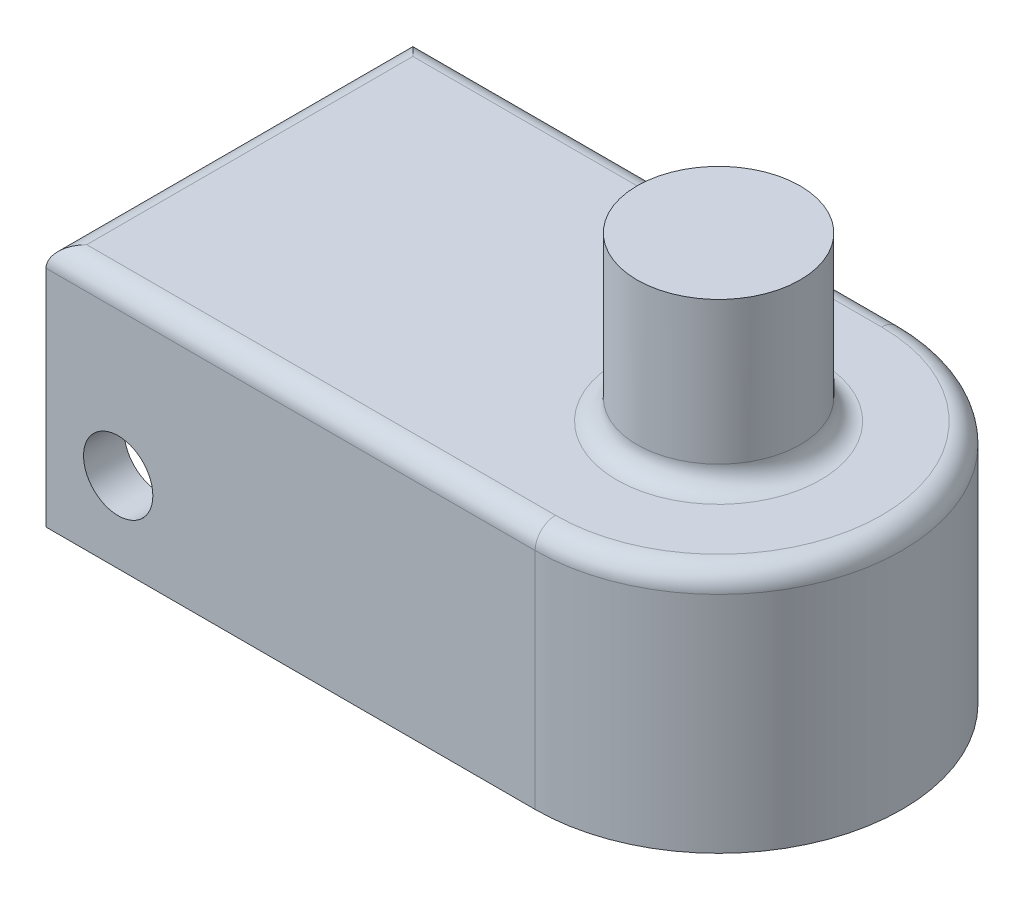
ISO-10303-21;
HEADER;
FILE_DESCRIPTION(('STEP AP214'),'2;1');
FILE_NAME('part.step','',(''),(''),'','','');
FILE_SCHEMA(('AUTOMOTIVE_DESIGN { 1 0 10303 214 1 1 1 1 }'));
ENDSEC;
DATA;
#1=APPLICATION_CONTEXT('core data for automotive mechanical design processes');
#2=APPLICATION_PROTOCOL_DEFINITION('international standard','automotive_design',2000,#1);
#3=PRODUCT_CONTEXT('',#1,'mechanical');
#4=PRODUCT('Part','Part','',(#3));
#5=PRODUCT_RELATED_PRODUCT_CATEGORY('part','',(#4));
#6=PRODUCT_DEFINITION_FORMATION('','',#4);
#7=PRODUCT_DEFINITION_CONTEXT('part definition',#1,'design');
#8=PRODUCT_DEFINITION('design','',#6,#7);
#9=PRODUCT_DEFINITION_SHAPE('','',#8);
#10=(LENGTH_UNIT() NAMED_UNIT(*) SI_UNIT(.MILLI.,.METRE.));
#11=(NAMED_UNIT(*) PLANE_ANGLE_UNIT() SI_UNIT($,.RADIAN.));
#12=(NAMED_UNIT(*) SI_UNIT($,.STERADIAN.) SOLID_ANGLE_UNIT());
#13=UNCERTAINTY_MEASURE_WITH_UNIT(LENGTH_MEASURE(1.E-05),#10,'distance_accuracy_value','');
#14=(GEOMETRIC_REPRESENTATION_CONTEXT(3) GLOBAL_UNCERTAINTY_ASSIGNED_CONTEXT((#13)) GLOBAL_UNIT_ASSIGNED_CONTEXT((#10,
#11,#12)) REPRESENTATION_CONTEXT('',''));
#15=CARTESIAN_POINT('',(0.,0.,0.));
#16=DIRECTION('',(0.,0.,1.));
#17=DIRECTION('',(1.,0.,0.));
#18=AXIS2_PLACEMENT_3D('',#15,#16,#17);
#19=CARTESIAN_POINT('',(152.4,76.2,-57.15));
#20=DIRECTION('',(0.,-1.,0.));
#21=DIRECTION('',(0.,0.,-1.));
#22=AXIS2_PLACEMENT_3D('',#19,#20,#21);
#23=PLANE('',#22);
#24=CARTESIAN_POINT('',(152.4,76.2,-57.15));
#25=DIRECTION('',(0.,-1.,0.));
#26=DIRECTION('',(0.,0.,-1.));
#27=AXIS2_PLACEMENT_3D('',#24,#25,#26);
#28=CIRCLE('',#27,31.75);
#29=CARTESIAN_POINT('',(152.4,76.2,-88.9));
#30=VERTEX_POINT('',#29);
#31=EDGE_CURVE('E185',#30,#30,#28,.T.);
#32=ORIENTED_EDGE('',*,*,#31,.T.);
#33=EDGE_LOOP('',(#32));
#34=FACE_BOUND('',#33,.T.);
#35=CARTESIAN_POINT('',(152.4,76.2,-57.15));
#36=DIRECTION('',(0.,-1.,0.));
#37=DIRECTION('',(0.,0.,-1.));
#38=AXIS2_PLACEMENT_3D('',#35,#36,#37);
#39=CIRCLE('',#38,50.8);
#40=CARTESIAN_POINT('',(152.4,76.2,-6.35));
#41=VERTEX_POINT('',#40);
#42=CARTESIAN_POINT('',(152.4,76.2,-107.95));
#43=VERTEX_POINT('',#42);
#44=EDGE_CURVE('E180',#41,#43,#39,.F.);
#45=ORIENTED_EDGE('',*,*,#44,.T.);
#46=DIRECTION('',(-1.,0.,0.));
#47=VECTOR('',#46,1.);
#48=CARTESIAN_POINT('',(152.4,76.2,-107.95));
#49=LINE('',#48,#47);
#50=CARTESIAN_POINT('',(6.34999999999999,76.2,-107.95));
#51=VERTEX_POINT('',#50);
#52=EDGE_CURVE('E182',#43,#51,#49,.T.);
#53=ORIENTED_EDGE('',*,*,#52,.T.);
#54=DIRECTION('',(0.,0.,1.));
#55=VECTOR('',#54,1.);
#56=CARTESIAN_POINT('',(6.34999999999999,76.2,-57.15));
#57=LINE('',#56,#55);
#58=CARTESIAN_POINT('',(6.34999999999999,76.2,-6.35));
#59=VERTEX_POINT('',#58);
#60=EDGE_CURVE('E178',#51,#59,#57,.T.);
#61=ORIENTED_EDGE('',*,*,#60,.T.);
#62=DIRECTION('',(1.,0.,0.));
#63=VECTOR('',#62,1.);
#64=CARTESIAN_POINT('',(152.4,76.2,-6.35));
#65=LINE('',#64,#63);
#66=EDGE_CURVE('E172',#59,#41,#65,.T.);
#67=ORIENTED_EDGE('',*,*,#66,.T.);
#68=EDGE_LOOP('',(#45,#53,#61,#67));
#69=FACE_BOUND('',#68,.T.);
#70=ADVANCED_FACE('F31',(#34,#69),#23,.F.);
#71=CARTESIAN_POINT('',(0.,76.2,0.));
#72=DIRECTION('',(1.,0.,0.));
#73=DIRECTION('',(0.,0.,-1.));
#74=AXIS2_PLACEMENT_3D('',#71,#72,#73);
#75=PLANE('',#74);
#76=DIRECTION('',(0.,-1.,0.));
#77=VECTOR('',#76,1.);
#78=CARTESIAN_POINT('',(0.,76.2,0.));
#79=LINE('',#78,#77);
#80=CARTESIAN_POINT('',(0.,69.85,0.));
#81=VERTEX_POINT('',#80);
#82=CARTESIAN_POINT('',(0.,0.,0.));
#83=VERTEX_POINT('',#82);
#84=EDGE_CURVE('E170',#81,#83,#79,.T.);
#85=ORIENTED_EDGE('',*,*,#84,.F.);
#86=DIRECTION('',(0.,0.,1.));
#87=VECTOR('',#86,1.);
#88=CARTESIAN_POINT('',(0.,69.85,0.));
#89=LINE('',#88,#87);
#90=CARTESIAN_POINT('',(0.,69.85,-114.3));
#91=VERTEX_POINT('',#90);
#92=EDGE_CURVE('E40',#81,#91,#89,.F.);
#93=ORIENTED_EDGE('',*,*,#92,.T.);
#94=DIRECTION('',(0.,-1.,0.));
#95=VECTOR('',#94,1.);
#96=CARTESIAN_POINT('',(0.,76.2,-114.3));
#97=LINE('',#96,#95);
#98=CARTESIAN_POINT('',(0.,0.,-114.3));
#99=VERTEX_POINT('',#98);
#100=EDGE_CURVE('E164',#91,#99,#97,.T.);
#101=ORIENTED_EDGE('',*,*,#100,.T.);
#102=DIRECTION('',(0.,0.,1.));
#103=VECTOR('',#102,1.);
#104=CARTESIAN_POINT('',(0.,0.,0.));
#105=LINE('',#104,#103);
#106=CARTESIAN_POINT('',(0.,0.,-101.6));
#107=VERTEX_POINT('',#106);
#108=EDGE_CURVE('E153',#99,#107,#105,.T.);
#109=ORIENTED_EDGE('',*,*,#108,.T.);
#110=DIRECTION('',(0.,-1.,0.));
#111=VECTOR('',#110,1.);
#112=CARTESIAN_POINT('',(0.,37.592,-101.6));
#113=LINE('',#112,#111);
#114=CARTESIAN_POINT('',(0.,37.592,-101.6));
#115=VERTEX_POINT('',#114);
#116=EDGE_CURVE('E120',#115,#107,#113,.T.);
#117=ORIENTED_EDGE('',*,*,#116,.F.);
#118=DIRECTION('',(0.,0.,-1.));
#119=VECTOR('',#118,1.);
#120=CARTESIAN_POINT('',(0.,37.592,-12.7));
#121=LINE('',#120,#119);
#122=CARTESIAN_POINT('',(0.,37.592,-12.7));
#123=VERTEX_POINT('',#122);
#124=EDGE_CURVE('E127',#123,#115,#121,.T.);
#125=ORIENTED_EDGE('',*,*,#124,.F.);
#126=DIRECTION('',(0.,-1.,0.));
#127=VECTOR('',#126,1.);
#128=CARTESIAN_POINT('',(0.,37.592,-12.7));
#129=LINE('',#128,#127);
#130=CARTESIAN_POINT('',(0.,0.,-12.7));
#131=VERTEX_POINT('',#130);
#132=EDGE_CURVE('E109',#123,#131,#129,.T.);
#133=ORIENTED_EDGE('',*,*,#132,.T.);
#134=EDGE_CURVE('E149',#131,#83,#105,.T.);
#135=ORIENTED_EDGE('',*,*,#134,.T.);
#136=EDGE_LOOP('',(#85,#93,#101,#109,#117,#125,#133,#135));
#137=FACE_BOUND('',#136,.T.);
#138=ADVANCED_FACE('F132',(#137),#75,.F.);
#139=CARTESIAN_POINT('',(0.,76.2,0.));
#140=DIRECTION('',(0.,0.,-1.));
#141=DIRECTION('',(-1.,0.,0.));
#142=AXIS2_PLACEMENT_3D('',#139,#140,#141);
#143=PLANE('',#142);
#144=CARTESIAN_POINT('',(22.4900013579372,25.1025379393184,0.));
#145=DIRECTION('',(0.,0.,1.));
#146=DIRECTION('',(1.,0.,0.));
#147=AXIS2_PLACEMENT_3D('',#144,#145,#146);
#148=CIRCLE('',#147,10.7961289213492);
#149=CARTESIAN_POINT('',(33.2861302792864,25.1025379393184,0.));
#150=VERTEX_POINT('',#149);
#151=EDGE_CURVE('E211',#150,#150,#148,.T.);
#152=ORIENTED_EDGE('',*,*,#151,.F.);
#153=EDGE_LOOP('',(#152));
#154=FACE_BOUND('',#153,.T.);
#155=DIRECTION('',(0.,-1.,0.));
#156=VECTOR('',#155,1.);
#157=CARTESIAN_POINT('',(152.4,76.2,0.));
#158=LINE('',#157,#156);
#159=CARTESIAN_POINT('',(152.4,69.85,0.));
#160=VERTEX_POINT('',#159);
#161=CARTESIAN_POINT('',(152.4,0.,0.));
#162=VERTEX_POINT('',#161);
#163=EDGE_CURVE('E168',#160,#162,#158,.T.);
#164=ORIENTED_EDGE('',*,*,#163,.F.);
#165=DIRECTION('',(1.,0.,0.));
#166=VECTOR('',#165,1.);
#167=CARTESIAN_POINT('',(0.,69.85,0.));
#168=LINE('',#167,#166);
#169=EDGE_CURVE('E11',#160,#81,#168,.F.);
#170=ORIENTED_EDGE('',*,*,#169,.T.);
#171=ORIENTED_EDGE('',*,*,#84,.T.);
#172=DIRECTION('',(1.,0.,0.));
#173=VECTOR('',#172,1.);
#174=CARTESIAN_POINT('',(0.,0.,0.));
#175=LINE('',#174,#173);
#176=EDGE_CURVE('E155',#83,#162,#175,.T.);
#177=ORIENTED_EDGE('',*,*,#176,.T.);
#178=EDGE_LOOP('',(#164,#170,#171,#177));
#179=FACE_BOUND('',#178,.T.);
#180=ADVANCED_FACE('F244',(#154,#179),#143,.F.);
#181=CARTESIAN_POINT('',(152.4,76.2,-57.15));
#182=DIRECTION('',(0.,-1.,0.));
#183=DIRECTION('',(0.,0.,-1.));
#184=AXIS2_PLACEMENT_3D('',#181,#182,#183);
#185=CYLINDRICAL_SURFACE('',#184,57.15);
#186=DIRECTION('',(0.,-1.,0.));
#187=VECTOR('',#186,1.);
#188=CARTESIAN_POINT('',(152.4,76.2,-114.3));
#189=LINE('',#188,#187);
#190=CARTESIAN_POINT('',(152.4,69.85,-114.3));
#191=VERTEX_POINT('',#190);
#192=CARTESIAN_POINT('',(152.4,0.,-114.3));
#193=VERTEX_POINT('',#192);
#194=EDGE_CURVE('E166',#191,#193,#189,.T.);
#195=ORIENTED_EDGE('',*,*,#194,.F.);
#196=CARTESIAN_POINT('',(152.4,69.85,-57.15));
#197=DIRECTION('',(0.,-1.,0.));
#198=DIRECTION('',(0.,0.,-1.));
#199=AXIS2_PLACEMENT_3D('',#196,#197,#198);
#200=CIRCLE('',#199,57.15);
#201=EDGE_CURVE('E54',#191,#160,#200,.T.);
#202=ORIENTED_EDGE('',*,*,#201,.T.);
#203=ORIENTED_EDGE('',*,*,#163,.T.);
#204=CARTESIAN_POINT('',(152.4,0.,-57.15));
#205=DIRECTION('',(0.,1.,0.));
#206=DIRECTION('',(0.,0.,-1.));
#207=AXIS2_PLACEMENT_3D('',#204,#205,#206);
#208=CIRCLE('',#207,57.15);
#209=EDGE_CURVE('E158',#162,#193,#208,.T.);
#210=ORIENTED_EDGE('',*,*,#209,.T.);
#211=EDGE_LOOP('',(#195,#202,#203,#210));
#212=FACE_BOUND('',#211,.T.);
#213=ADVANCED_FACE('F257',(#212),#185,.T.);
#214=CARTESIAN_POINT('',(0.,76.2,-114.3));
#215=DIRECTION('',(0.,0.,1.));
#216=DIRECTION('',(1.,0.,0.));
#217=AXIS2_PLACEMENT_3D('',#214,#215,#216);
#218=PLANE('',#217);
#219=CARTESIAN_POINT('',(22.4900013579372,25.1025379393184,-114.3));
#220=DIRECTION('',(0.,0.,1.));
#221=DIRECTION('',(1.,0.,0.));
#222=AXIS2_PLACEMENT_3D('',#219,#220,#221);
#223=CIRCLE('',#222,10.7961289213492);
#224=CARTESIAN_POINT('',(33.2861302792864,25.1025379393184,-114.3));
#225=VERTEX_POINT('',#224);
#226=EDGE_CURVE('E176',#225,#225,#223,.T.);
#227=ORIENTED_EDGE('',*,*,#226,.T.);
#228=EDGE_LOOP('',(#227));
#229=FACE_BOUND('',#228,.T.);
#230=ORIENTED_EDGE('',*,*,#100,.F.);
#231=DIRECTION('',(-1.,0.,0.));
#232=VECTOR('',#231,1.);
#233=CARTESIAN_POINT('',(0.,69.85,-114.3));
#234=LINE('',#233,#232);
#235=EDGE_CURVE('E188',#91,#191,#234,.F.);
#236=ORIENTED_EDGE('',*,*,#235,.T.);
#237=ORIENTED_EDGE('',*,*,#194,.T.);
#238=DIRECTION('',(-1.,0.,0.));
#239=VECTOR('',#238,1.);
#240=CARTESIAN_POINT('',(0.,0.,-114.3));
#241=LINE('',#240,#239);
#242=EDGE_CURVE('E161',#193,#99,#241,.T.);
#243=ORIENTED_EDGE('',*,*,#242,.T.);
#244=EDGE_LOOP('',(#230,#236,#237,#243));
#245=FACE_BOUND('',#244,.T.);
#246=ADVANCED_FACE('F253',(#229,#245),#218,.F.);
#247=CARTESIAN_POINT('',(152.4,0.,-57.15));
#248=DIRECTION('',(0.,-1.,0.));
#249=DIRECTION('',(0.,0.,-1.));
#250=AXIS2_PLACEMENT_3D('',#247,#248,#249);
#251=PLANE('',#250);
#252=DIRECTION('',(-1.,0.,0.));
#253=VECTOR('',#252,1.);
#254=CARTESIAN_POINT('',(152.4,0.,-12.7));
#255=LINE('',#254,#253);
#256=CARTESIAN_POINT('',(152.4,0.,-12.7));
#257=VERTEX_POINT('',#256);
#258=EDGE_CURVE('E115',#257,#131,#255,.T.);
#259=ORIENTED_EDGE('',*,*,#258,.F.);
#260=CARTESIAN_POINT('',(152.4,0.,-57.15));
#261=DIRECTION('',(0.,-1.,0.));
#262=DIRECTION('',(0.,0.,-1.));
#263=AXIS2_PLACEMENT_3D('',#260,#261,#262);
#264=CIRCLE('',#263,44.45);
#265=CARTESIAN_POINT('',(152.4,0.,-101.6));
#266=VERTEX_POINT('',#265);
#267=EDGE_CURVE('E130',#266,#257,#264,.T.);
#268=ORIENTED_EDGE('',*,*,#267,.F.);
#269=DIRECTION('',(1.,0.,0.));
#270=VECTOR('',#269,1.);
#271=CARTESIAN_POINT('',(0.,0.,-101.6));
#272=LINE('',#271,#270);
#273=EDGE_CURVE('E141',#107,#266,#272,.T.);
#274=ORIENTED_EDGE('',*,*,#273,.F.);
#275=ORIENTED_EDGE('',*,*,#108,.F.);
#276=ORIENTED_EDGE('',*,*,#242,.F.);
#277=ORIENTED_EDGE('',*,*,#209,.F.);
#278=ORIENTED_EDGE('',*,*,#176,.F.);
#279=ORIENTED_EDGE('',*,*,#134,.F.);
#280=EDGE_LOOP('',(#259,#268,#274,#275,#276,#277,#278,#279));
#281=FACE_BOUND('',#280,.T.);
#282=ADVANCED_FACE('F250',(#281),#251,.T.);
#283=CARTESIAN_POINT('',(152.4,37.592,-12.7));
#284=DIRECTION('',(0.,0.,1.));
#285=DIRECTION('',(1.,0.,0.));
#286=AXIS2_PLACEMENT_3D('',#283,#284,#285);
#287=PLANE('',#286);
#288=CARTESIAN_POINT('',(22.4900013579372,25.1025379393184,-12.7));
#289=DIRECTION('',(0.,0.,1.));
#290=DIRECTION('',(1.,0.,0.));
#291=AXIS2_PLACEMENT_3D('',#288,#289,#290);
#292=CIRCLE('',#291,10.7961289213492);
#293=CARTESIAN_POINT('',(33.2861302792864,25.1025379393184,-12.7));
#294=VERTEX_POINT('',#293);
#295=EDGE_CURVE('E142',#294,#294,#292,.T.);
#296=ORIENTED_EDGE('',*,*,#295,.T.);
#297=EDGE_LOOP('',(#296));
#298=FACE_BOUND('',#297,.T.);
#299=ORIENTED_EDGE('',*,*,#258,.T.);
#300=ORIENTED_EDGE('',*,*,#132,.F.);
#301=DIRECTION('',(-1.,0.,0.));
#302=VECTOR('',#301,1.);
#303=CARTESIAN_POINT('',(152.4,37.592,-12.7));
#304=LINE('',#303,#302);
#305=CARTESIAN_POINT('',(152.4,37.592,-12.7));
#306=VERTEX_POINT('',#305);
#307=EDGE_CURVE('E112',#306,#123,#304,.T.);
#308=ORIENTED_EDGE('',*,*,#307,.F.);
#309=DIRECTION('',(0.,-1.,0.));
#310=VECTOR('',#309,1.);
#311=CARTESIAN_POINT('',(152.4,37.592,-12.7));
#312=LINE('',#311,#310);
#313=EDGE_CURVE('E147',#306,#257,#312,.T.);
#314=ORIENTED_EDGE('',*,*,#313,.T.);
#315=EDGE_LOOP('',(#299,#300,#308,#314));
#316=FACE_BOUND('',#315,.T.);
#317=ADVANCED_FACE('F111',(#298,#316),#287,.F.);
#318=CARTESIAN_POINT('',(152.4,37.592,-57.15));
#319=DIRECTION('',(0.,-1.,0.));
#320=DIRECTION('',(0.,0.,-1.));
#321=AXIS2_PLACEMENT_3D('',#318,#319,#320);
#322=CYLINDRICAL_SURFACE('',#321,44.45);
#323=ORIENTED_EDGE('',*,*,#267,.T.);
#324=ORIENTED_EDGE('',*,*,#313,.F.);
#325=CARTESIAN_POINT('',(152.4,37.592,-57.15));
#326=DIRECTION('',(0.,-1.,0.));
#327=DIRECTION('',(0.,0.,-1.));
#328=AXIS2_PLACEMENT_3D('',#325,#326,#327);
#329=CIRCLE('',#328,44.45);
#330=CARTESIAN_POINT('',(152.4,37.592,-101.6));
#331=VERTEX_POINT('',#330);
#332=EDGE_CURVE('E121',#331,#306,#329,.T.);
#333=ORIENTED_EDGE('',*,*,#332,.F.);
#334=DIRECTION('',(0.,-1.,0.));
#335=VECTOR('',#334,1.);
#336=CARTESIAN_POINT('',(152.4,37.592,-101.6));
#337=LINE('',#336,#335);
#338=EDGE_CURVE('E150',#331,#266,#337,.T.);
#339=ORIENTED_EDGE('',*,*,#338,.T.);
#340=EDGE_LOOP('',(#323,#324,#333,#339));
#341=FACE_BOUND('',#340,.T.);
#342=ADVANCED_FACE('F295',(#341),#322,.F.);
#343=CARTESIAN_POINT('',(0.,37.592,-101.6));
#344=DIRECTION('',(0.,0.,-1.));
#345=DIRECTION('',(-1.,0.,0.));
#346=AXIS2_PLACEMENT_3D('',#343,#344,#345);
#347=PLANE('',#346);
#348=CARTESIAN_POINT('',(22.4900013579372,25.1025379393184,-101.6));
#349=DIRECTION('',(0.,0.,-1.));
#350=DIRECTION('',(-1.,0.,0.));
#351=AXIS2_PLACEMENT_3D('',#348,#349,#350);
#352=CIRCLE('',#351,10.7961289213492);
#353=CARTESIAN_POINT('',(33.2861302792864,25.1025379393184,-101.6));
#354=VERTEX_POINT('',#353);
#355=EDGE_CURVE('E173',#354,#354,#352,.T.);
#356=ORIENTED_EDGE('',*,*,#355,.T.);
#357=EDGE_LOOP('',(#356));
#358=FACE_BOUND('',#357,.T.);
#359=ORIENTED_EDGE('',*,*,#273,.T.);
#360=ORIENTED_EDGE('',*,*,#338,.F.);
#361=DIRECTION('',(1.,0.,0.));
#362=VECTOR('',#361,1.);
#363=CARTESIAN_POINT('',(0.,37.592,-101.6));
#364=LINE('',#363,#362);
#365=EDGE_CURVE('E134',#115,#331,#364,.T.);
#366=ORIENTED_EDGE('',*,*,#365,.F.);
#367=ORIENTED_EDGE('',*,*,#116,.T.);
#368=EDGE_LOOP('',(#359,#360,#366,#367));
#369=FACE_BOUND('',#368,.T.);
#370=ADVANCED_FACE('F293',(#358,#369),#347,.F.);
#371=CARTESIAN_POINT('',(152.4,37.592,-57.15));
#372=DIRECTION('',(0.,-1.,0.));
#373=DIRECTION('',(0.,0.,-1.));
#374=AXIS2_PLACEMENT_3D('',#371,#372,#373);
#375=PLANE('',#374);
#376=ORIENTED_EDGE('',*,*,#307,.T.);
#377=ORIENTED_EDGE('',*,*,#124,.T.);
#378=ORIENTED_EDGE('',*,*,#365,.T.);
#379=ORIENTED_EDGE('',*,*,#332,.T.);
#380=EDGE_LOOP('',(#376,#377,#378,#379));
#381=FACE_BOUND('',#380,.T.);
#382=ADVANCED_FACE('F125',(#381),#375,.T.);
#383=CARTESIAN_POINT('',(22.4900013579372,25.1025379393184,-114.3));
#384=DIRECTION('',(0.,0.,1.));
#385=DIRECTION('',(1.,0.,0.));
#386=AXIS2_PLACEMENT_3D('',#383,#384,#385);
#387=CYLINDRICAL_SURFACE('',#386,10.7961289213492);
#388=CARTESIAN_POINT('',(33.2861302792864,25.1025379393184,-114.3));
#389=CARTESIAN_POINT('',(33.2861302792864,25.1025379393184,-114.167708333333));
#390=CARTESIAN_POINT('',(33.2861302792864,25.1025379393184,-114.035416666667));
#391=CARTESIAN_POINT('',(33.2861302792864,25.1025379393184,-113.770833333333));
#392=CARTESIAN_POINT('',(33.2861302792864,25.1025379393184,-113.638541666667));
#393=CARTESIAN_POINT('',(33.2861302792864,25.1025379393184,-113.373958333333));
#394=CARTESIAN_POINT('',(33.2861302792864,25.1025379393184,-113.241666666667));
#395=CARTESIAN_POINT('',(33.2861302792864,25.1025379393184,-112.977083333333));
#396=CARTESIAN_POINT('',(33.2861302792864,25.1025379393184,-112.844791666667));
#397=CARTESIAN_POINT('',(33.2861302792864,25.1025379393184,-112.580208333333));
#398=CARTESIAN_POINT('',(33.2861302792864,25.1025379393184,-112.447916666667));
#399=CARTESIAN_POINT('',(33.2861302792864,25.1025379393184,-112.183333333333));
#400=CARTESIAN_POINT('',(33.2861302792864,25.1025379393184,-112.051041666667));
#401=CARTESIAN_POINT('',(33.2861302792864,25.1025379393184,-111.786458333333));
#402=CARTESIAN_POINT('',(33.2861302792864,25.1025379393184,-111.654166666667));
#403=CARTESIAN_POINT('',(33.2861302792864,25.1025379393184,-111.389583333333));
#404=CARTESIAN_POINT('',(33.2861302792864,25.1025379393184,-111.257291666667));
#405=CARTESIAN_POINT('',(33.2861302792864,25.1025379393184,-110.992708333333));
#406=CARTESIAN_POINT('',(33.2861302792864,25.1025379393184,-110.860416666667));
#407=CARTESIAN_POINT('',(33.2861302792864,25.1025379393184,-110.595833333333));
#408=CARTESIAN_POINT('',(33.2861302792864,25.1025379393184,-110.463541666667));
#409=CARTESIAN_POINT('',(33.2861302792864,25.1025379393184,-110.198958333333));
#410=CARTESIAN_POINT('',(33.2861302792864,25.1025379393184,-110.066666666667));
#411=CARTESIAN_POINT('',(33.2861302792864,25.1025379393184,-109.802083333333));
#412=CARTESIAN_POINT('',(33.2861302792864,25.1025379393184,-109.669791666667));
#413=CARTESIAN_POINT('',(33.2861302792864,25.1025379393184,-109.405208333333));
#414=CARTESIAN_POINT('',(33.2861302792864,25.1025379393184,-109.272916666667));
#415=CARTESIAN_POINT('',(33.2861302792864,25.1025379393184,-109.008333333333));
#416=CARTESIAN_POINT('',(33.2861302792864,25.1025379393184,-108.876041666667));
#417=CARTESIAN_POINT('',(33.2861302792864,25.1025379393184,-108.611458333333));
#418=CARTESIAN_POINT('',(33.2861302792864,25.1025379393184,-108.479166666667));
#419=CARTESIAN_POINT('',(33.2861302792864,25.1025379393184,-108.214583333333));
#420=CARTESIAN_POINT('',(33.2861302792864,25.1025379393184,-108.082291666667));
#421=CARTESIAN_POINT('',(33.2861302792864,25.1025379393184,-107.817708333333));
#422=CARTESIAN_POINT('',(33.2861302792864,25.1025379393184,-107.685416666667));
#423=CARTESIAN_POINT('',(33.2861302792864,25.1025379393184,-107.420833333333));
#424=CARTESIAN_POINT('',(33.2861302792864,25.1025379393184,-107.288541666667));
#425=CARTESIAN_POINT('',(33.2861302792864,25.1025379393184,-107.023958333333));
#426=CARTESIAN_POINT('',(33.2861302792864,25.1025379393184,-106.891666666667));
#427=CARTESIAN_POINT('',(33.2861302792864,25.1025379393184,-106.627083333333));
#428=CARTESIAN_POINT('',(33.2861302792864,25.1025379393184,-106.494791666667));
#429=CARTESIAN_POINT('',(33.2861302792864,25.1025379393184,-106.230208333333));
#430=CARTESIAN_POINT('',(33.2861302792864,25.1025379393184,-106.097916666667));
#431=CARTESIAN_POINT('',(33.2861302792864,25.1025379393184,-105.833333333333));
#432=CARTESIAN_POINT('',(33.2861302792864,25.1025379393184,-105.701041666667));
#433=CARTESIAN_POINT('',(33.2861302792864,25.1025379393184,-105.436458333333));
#434=CARTESIAN_POINT('',(33.2861302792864,25.1025379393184,-105.304166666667));
#435=CARTESIAN_POINT('',(33.2861302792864,25.1025379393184,-105.039583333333));
#436=CARTESIAN_POINT('',(33.2861302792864,25.1025379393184,-104.907291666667));
#437=CARTESIAN_POINT('',(33.2861302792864,25.1025379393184,-104.642708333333));
#438=CARTESIAN_POINT('',(33.2861302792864,25.1025379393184,-104.510416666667));
#439=CARTESIAN_POINT('',(33.2861302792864,25.1025379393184,-104.245833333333));
#440=CARTESIAN_POINT('',(33.2861302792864,25.1025379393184,-104.113541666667));
#441=CARTESIAN_POINT('',(33.2861302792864,25.1025379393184,-103.848958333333));
#442=CARTESIAN_POINT('',(33.2861302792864,25.1025379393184,-103.716666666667));
#443=CARTESIAN_POINT('',(33.2861302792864,25.1025379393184,-103.452083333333));
#444=CARTESIAN_POINT('',(33.2861302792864,25.1025379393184,-103.319791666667));
#445=CARTESIAN_POINT('',(33.2861302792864,25.1025379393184,-103.055208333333));
#446=CARTESIAN_POINT('',(33.2861302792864,25.1025379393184,-102.922916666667));
#447=CARTESIAN_POINT('',(33.2861302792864,25.1025379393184,-102.658333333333));
#448=CARTESIAN_POINT('',(33.2861302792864,25.1025379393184,-102.526041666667));
#449=CARTESIAN_POINT('',(33.2861302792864,25.1025379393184,-102.261458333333));
#450=CARTESIAN_POINT('',(33.2861302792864,25.1025379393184,-102.129166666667));
#451=CARTESIAN_POINT('',(33.2861302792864,25.1025379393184,-101.864583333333));
#452=CARTESIAN_POINT('',(33.2861302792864,25.1025379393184,-101.732291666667));
#453=CARTESIAN_POINT('',(33.2861302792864,25.1025379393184,-101.6));
#454=B_SPLINE_CURVE_WITH_KNOTS('',3,(#388,#389,#390,#391,#392,#393,#394,#395,#396,#397,#398,
#399,#400,#401,#402,#403,#404,#405,#406,#407,#408,#409,#410,#411,#412,#413,#414,#415,#416,#417,
#418,#419,#420,#421,#422,#423,#424,#425,#426,#427,#428,#429,#430,#431,#432,#433,#434,#435,#436,
#437,#438,#439,#440,#441,#442,#443,#444,#445,#446,#447,#448,#449,#450,#451,#452,#453),
.UNSPECIFIED.,.F.,.F.,(4,2,2,2,2,2,2,2,2,2,2,2,2,2,2,2,2,2,2,2,2,2,2,2,2,2,2,2,2,2,2,2,4),(0.,
0.396875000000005,0.79375000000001,1.19062500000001,1.58750000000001,1.98437500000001,
2.38125000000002,2.77812500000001,3.17500000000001,3.57187500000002,3.96875000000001,
4.36562500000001,4.76250000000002,5.15937500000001,5.55625000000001,5.95312500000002,
6.35000000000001,6.74687500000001,7.14375000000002,7.54062500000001,7.93750000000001,
8.33437500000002,8.73125000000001,9.12812500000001,9.52500000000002,9.92187500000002,10.31875,
10.715625,11.1125,11.509375,11.90625,12.303125,12.7),.UNSPECIFIED.);
#455=EDGE_CURVE('BSEAM226',#225,#354,#454,.T.);
#456=ORIENTED_EDGE('',*,*,#226,.F.);
#457=ORIENTED_EDGE('',*,*,#355,.F.);
#458=ORIENTED_EDGE('',*,*,#455,.T.);
#459=ORIENTED_EDGE('',*,*,#455,.F.);
#460=EDGE_LOOP('',(#456,#458,#457,#459));
#461=FACE_BOUND('',#460,.T.);
#462=ADVANCED_FACE('F226',(#461),#387,.F.);
#463=CARTESIAN_POINT('',(33.2861302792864,25.1025379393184,0.));
#464=CARTESIAN_POINT('',(33.2861302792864,25.1025379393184,-0.132291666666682));
#465=CARTESIAN_POINT('',(33.2861302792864,25.1025379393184,-0.26458333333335));
#466=CARTESIAN_POINT('',(33.2861302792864,25.1025379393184,-0.529166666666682));
#467=CARTESIAN_POINT('',(33.2861302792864,25.1025379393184,-0.661458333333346));
#468=CARTESIAN_POINT('',(33.2861302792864,25.1025379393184,-0.926041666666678));
#469=CARTESIAN_POINT('',(33.2861302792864,25.1025379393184,-1.05833333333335));
#470=CARTESIAN_POINT('',(33.2861302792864,25.1025379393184,-1.32291666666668));
#471=CARTESIAN_POINT('',(33.2861302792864,25.1025379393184,-1.45520833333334));
#472=CARTESIAN_POINT('',(33.2861302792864,25.1025379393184,-1.71979166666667));
#473=CARTESIAN_POINT('',(33.2861302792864,25.1025379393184,-1.85208333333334));
#474=CARTESIAN_POINT('',(33.2861302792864,25.1025379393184,-2.11666666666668));
#475=CARTESIAN_POINT('',(33.2861302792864,25.1025379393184,-2.24895833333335));
#476=CARTESIAN_POINT('',(33.2861302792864,25.1025379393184,-2.51354166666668));
#477=CARTESIAN_POINT('',(33.2861302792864,25.1025379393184,-2.64583333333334));
#478=CARTESIAN_POINT('',(33.2861302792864,25.1025379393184,-2.91041666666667));
#479=CARTESIAN_POINT('',(33.2861302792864,25.1025379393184,-3.04270833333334));
#480=CARTESIAN_POINT('',(33.2861302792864,25.1025379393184,-3.30729166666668));
#481=CARTESIAN_POINT('',(33.2861302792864,25.1025379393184,-3.43958333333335));
#482=CARTESIAN_POINT('',(33.2861302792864,25.1025379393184,-3.70416666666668));
#483=CARTESIAN_POINT('',(33.2861302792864,25.1025379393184,-3.83645833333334));
#484=CARTESIAN_POINT('',(33.2861302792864,25.1025379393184,-4.10104166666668));
#485=CARTESIAN_POINT('',(33.2861302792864,25.1025379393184,-4.23333333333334));
#486=CARTESIAN_POINT('',(33.2861302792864,25.1025379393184,-4.49791666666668));
#487=CARTESIAN_POINT('',(33.2861302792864,25.1025379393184,-4.63020833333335));
#488=CARTESIAN_POINT('',(33.2861302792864,25.1025379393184,-4.89479166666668));
#489=CARTESIAN_POINT('',(33.2861302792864,25.1025379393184,-5.02708333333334));
#490=CARTESIAN_POINT('',(33.2861302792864,25.1025379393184,-5.29166666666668));
#491=CARTESIAN_POINT('',(33.2861302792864,25.1025379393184,-5.42395833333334));
#492=CARTESIAN_POINT('',(33.2861302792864,25.1025379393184,-5.68854166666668));
#493=CARTESIAN_POINT('',(33.2861302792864,25.1025379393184,-5.82083333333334));
#494=CARTESIAN_POINT('',(33.2861302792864,25.1025379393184,-6.08541666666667));
#495=CARTESIAN_POINT('',(33.2861302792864,25.1025379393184,-6.21770833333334));
#496=CARTESIAN_POINT('',(33.2861302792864,25.1025379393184,-6.48229166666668));
#497=CARTESIAN_POINT('',(33.2861302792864,25.1025379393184,-6.61458333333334));
#498=CARTESIAN_POINT('',(33.2861302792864,25.1025379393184,-6.87916666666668));
#499=CARTESIAN_POINT('',(33.2861302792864,25.1025379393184,-7.01145833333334));
#500=CARTESIAN_POINT('',(33.2861302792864,25.1025379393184,-7.27604166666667));
#501=CARTESIAN_POINT('',(33.2861302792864,25.1025379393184,-7.40833333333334));
#502=CARTESIAN_POINT('',(33.2861302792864,25.1025379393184,-7.67291666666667));
#503=CARTESIAN_POINT('',(33.2861302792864,25.1025379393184,-7.80520833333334));
#504=CARTESIAN_POINT('',(33.2861302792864,25.1025379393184,-8.06979166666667));
#505=CARTESIAN_POINT('',(33.2861302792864,25.1025379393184,-8.20208333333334));
#506=CARTESIAN_POINT('',(33.2861302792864,25.1025379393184,-8.46666666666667));
#507=CARTESIAN_POINT('',(33.2861302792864,25.1025379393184,-8.59895833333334));
#508=CARTESIAN_POINT('',(33.2861302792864,25.1025379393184,-8.86354166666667));
#509=CARTESIAN_POINT('',(33.2861302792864,25.1025379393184,-8.99583333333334));
#510=CARTESIAN_POINT('',(33.2861302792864,25.1025379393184,-9.26041666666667));
#511=CARTESIAN_POINT('',(33.2861302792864,25.1025379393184,-9.39270833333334));
#512=CARTESIAN_POINT('',(33.2861302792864,25.1025379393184,-9.65729166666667));
#513=CARTESIAN_POINT('',(33.2861302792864,25.1025379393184,-9.78958333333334));
#514=CARTESIAN_POINT('',(33.2861302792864,25.1025379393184,-10.0541666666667));
#515=CARTESIAN_POINT('',(33.2861302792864,25.1025379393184,-10.1864583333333));
#516=CARTESIAN_POINT('',(33.2861302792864,25.1025379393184,-10.4510416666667));
#517=CARTESIAN_POINT('',(33.2861302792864,25.1025379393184,-10.5833333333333));
#518=CARTESIAN_POINT('',(33.2861302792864,25.1025379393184,-10.8479166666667));
#519=CARTESIAN_POINT('',(33.2861302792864,25.1025379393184,-10.9802083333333));
#520=CARTESIAN_POINT('',(33.2861302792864,25.1025379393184,-11.2447916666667));
#521=CARTESIAN_POINT('',(33.2861302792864,25.1025379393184,-11.3770833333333));
#522=CARTESIAN_POINT('',(33.2861302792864,25.1025379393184,-11.6416666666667));
#523=CARTESIAN_POINT('',(33.2861302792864,25.1025379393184,-11.7739583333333));
#524=CARTESIAN_POINT('',(33.2861302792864,25.1025379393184,-12.0385416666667));
#525=CARTESIAN_POINT('',(33.2861302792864,25.1025379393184,-12.1708333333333));
#526=CARTESIAN_POINT('',(33.2861302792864,25.1025379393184,-12.4354166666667));
#527=CARTESIAN_POINT('',(33.2861302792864,25.1025379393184,-12.5677083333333));
#528=CARTESIAN_POINT('',(33.2861302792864,25.1025379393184,-12.7));
#529=B_SPLINE_CURVE_WITH_KNOTS('',3,(#463,#464,#465,#466,#467,#468,#469,#470,#471,#472,#473,
#474,#475,#476,#477,#478,#479,#480,#481,#482,#483,#484,#485,#486,#487,#488,#489,#490,#491,#492,
#493,#494,#495,#496,#497,#498,#499,#500,#501,#502,#503,#504,#505,#506,#507,#508,#509,#510,#511,
#512,#513,#514,#515,#516,#517,#518,#519,#520,#521,#522,#523,#524,#525,#526,#527,#528),
.UNSPECIFIED.,.F.,.F.,(4,2,2,2,2,2,2,2,2,2,2,2,2,2,2,2,2,2,2,2,2,2,2,2,2,2,2,2,2,2,2,2,4),(0.,
0.396875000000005,0.793749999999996,1.190625,1.58749999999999,1.984375,2.38125,2.77812499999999,
3.175,3.571875,3.96874999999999,4.365625,4.7625,5.15937499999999,5.55625,5.95312499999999,
6.34999999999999,6.746875,7.14374999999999,7.540625,7.93749999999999,8.33437499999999,8.73125,
9.12812499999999,9.52499999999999,9.921875,10.31875,10.715625,11.1125,11.509375,11.90625,
12.303125,12.7),.UNSPECIFIED.);
#530=EDGE_CURVE('BSEAM223',#150,#294,#529,.T.);
#531=ORIENTED_EDGE('',*,*,#151,.T.);
#532=ORIENTED_EDGE('',*,*,#295,.F.);
#533=ORIENTED_EDGE('',*,*,#530,.T.);
#534=ORIENTED_EDGE('',*,*,#530,.F.);
#535=EDGE_LOOP('',(#531,#533,#532,#534));
#536=FACE_BOUND('',#535,.T.);
#537=ADVANCED_FACE('F223',(#536),#387,.F.);
#538=CARTESIAN_POINT('',(152.4,127.,-57.15));
#539=DIRECTION('',(0.,-1.,0.));
#540=DIRECTION('',(0.,0.,-1.));
#541=AXIS2_PLACEMENT_3D('',#538,#539,#540);
#542=CYLINDRICAL_SURFACE('',#541,25.4);
#543=CARTESIAN_POINT('',(152.4,82.55,-57.15));
#544=DIRECTION('',(0.,-1.,0.));
#545=DIRECTION('',(0.,0.,-1.));
#546=AXIS2_PLACEMENT_3D('',#543,#544,#545);
#547=CIRCLE('',#546,25.4);
#548=CARTESIAN_POINT('',(152.4,82.55,-82.55));
#549=VERTEX_POINT('',#548);
#550=EDGE_CURVE('E192',#549,#549,#547,.F.);
#551=ORIENTED_EDGE('',*,*,#550,.T.);
#552=EDGE_LOOP('',(#551));
#553=FACE_BOUND('',#552,.T.);
#554=CARTESIAN_POINT('',(152.4,127.,-57.15));
#555=DIRECTION('',(0.,1.,0.));
#556=DIRECTION('',(0.,0.,1.));
#557=AXIS2_PLACEMENT_3D('',#554,#555,#556);
#558=CIRCLE('',#557,25.4);
#559=CARTESIAN_POINT('',(152.4,127.,-31.75));
#560=VERTEX_POINT('',#559);
#561=EDGE_CURVE('E206',#560,#560,#558,.T.);
#562=ORIENTED_EDGE('',*,*,#561,.F.);
#563=EDGE_LOOP('',(#562));
#564=FACE_BOUND('',#563,.T.);
#565=ADVANCED_FACE('F225',(#553,#564),#542,.T.);
#566=CARTESIAN_POINT('',(152.4,127.,-57.15));
#567=DIRECTION('',(0.,1.,0.));
#568=DIRECTION('',(0.,0.,1.));
#569=AXIS2_PLACEMENT_3D('',#566,#567,#568);
#570=PLANE('',#569);
#571=ORIENTED_EDGE('',*,*,#561,.T.);
#572=EDGE_LOOP('',(#571));
#573=FACE_BOUND('',#572,.T.);
#574=ADVANCED_FACE('F233',(#573),#570,.T.);
#575=CARTESIAN_POINT('',(152.4,69.85,-6.35));
#576=DIRECTION('',(1.,0.,0.));
#577=DIRECTION('',(0.,0.,-1.));
#578=AXIS2_PLACEMENT_3D('',#575,#576,#577);
#579=CYLINDRICAL_SURFACE('',#578,6.35);
#580=CARTESIAN_POINT('',(6.34999999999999,69.85,-6.35));
#581=DIRECTION('',(0.707106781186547,0.,0.707106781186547));
#582=DIRECTION('',(0.707106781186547,0.,-0.707106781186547));
#583=AXIS2_PLACEMENT_3D('',#580,#581,#582);
#584=ELLIPSE('',#583,8.98025612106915,6.35);
#585=EDGE_CURVE('E199',#81,#59,#584,.F.);
#586=ORIENTED_EDGE('',*,*,#585,.F.);
#587=ORIENTED_EDGE('',*,*,#169,.F.);
#588=CARTESIAN_POINT('',(152.4,69.85,-6.35));
#589=DIRECTION('',(1.,0.,0.));
#590=DIRECTION('',(0.,0.,-1.));
#591=AXIS2_PLACEMENT_3D('',#588,#589,#590);
#592=CIRCLE('',#591,6.35);
#593=EDGE_CURVE('E35',#41,#160,#592,.T.);
#594=ORIENTED_EDGE('',*,*,#593,.F.);
#595=ORIENTED_EDGE('',*,*,#66,.F.);
#596=EDGE_LOOP('',(#586,#587,#594,#595));
#597=FACE_BOUND('',#596,.T.);
#598=ADVANCED_FACE('F273',(#597),#579,.T.);
#599=CARTESIAN_POINT('',(152.4,69.85,-57.15));
#600=DIRECTION('',(0.,-1.,0.));
#601=DIRECTION('',(0.,0.,-1.));
#602=AXIS2_PLACEMENT_3D('',#599,#600,#601);
#603=TOROIDAL_SURFACE('',#602,50.8,6.35);
#604=ORIENTED_EDGE('',*,*,#593,.T.);
#605=ORIENTED_EDGE('',*,*,#201,.F.);
#606=CARTESIAN_POINT('',(152.4,69.85,-107.95));
#607=DIRECTION('',(-1.,0.,0.));
#608=DIRECTION('',(0.,0.,1.));
#609=AXIS2_PLACEMENT_3D('',#606,#607,#608);
#610=CIRCLE('',#609,6.35);
#611=EDGE_CURVE('E198',#43,#191,#610,.T.);
#612=ORIENTED_EDGE('',*,*,#611,.F.);
#613=ORIENTED_EDGE('',*,*,#44,.F.);
#614=EDGE_LOOP('',(#604,#605,#612,#613));
#615=FACE_BOUND('',#614,.T.);
#616=ADVANCED_FACE('F271',(#615),#603,.T.);
#617=CARTESIAN_POINT('',(6.34999999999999,69.85,-57.15));
#618=DIRECTION('',(0.,0.,1.));
#619=DIRECTION('',(1.,0.,0.));
#620=AXIS2_PLACEMENT_3D('',#617,#618,#619);
#621=CYLINDRICAL_SURFACE('',#620,6.35);
#622=ORIENTED_EDGE('',*,*,#585,.T.);
#623=ORIENTED_EDGE('',*,*,#60,.F.);
#624=CARTESIAN_POINT('',(6.34999999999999,69.85,-107.95));
#625=DIRECTION('',(-0.707106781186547,0.,0.707106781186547));
#626=DIRECTION('',(0.707106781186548,0.,0.707106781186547));
#627=AXIS2_PLACEMENT_3D('',#624,#625,#626);
#628=ELLIPSE('',#627,8.98025612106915,6.35);
#629=EDGE_CURVE('E196',#91,#51,#628,.F.);
#630=ORIENTED_EDGE('',*,*,#629,.F.);
#631=ORIENTED_EDGE('',*,*,#92,.F.);
#632=EDGE_LOOP('',(#622,#623,#630,#631));
#633=FACE_BOUND('',#632,.T.);
#634=ADVANCED_FACE('F267',(#633),#621,.T.);
#635=CARTESIAN_POINT('',(152.4,69.85,-107.95));
#636=DIRECTION('',(-1.,0.,0.));
#637=DIRECTION('',(0.,0.,1.));
#638=AXIS2_PLACEMENT_3D('',#635,#636,#637);
#639=CYLINDRICAL_SURFACE('',#638,6.35);
#640=ORIENTED_EDGE('',*,*,#611,.T.);
#641=ORIENTED_EDGE('',*,*,#235,.F.);
#642=ORIENTED_EDGE('',*,*,#629,.T.);
#643=ORIENTED_EDGE('',*,*,#52,.F.);
#644=EDGE_LOOP('',(#640,#641,#642,#643));
#645=FACE_BOUND('',#644,.T.);
#646=ADVANCED_FACE('F264',(#645),#639,.T.);
#647=CARTESIAN_POINT('',(152.4,82.55,-57.15));
#648=DIRECTION('',(0.,-1.,0.));
#649=DIRECTION('',(0.,0.,-1.));
#650=AXIS2_PLACEMENT_3D('',#647,#648,#649);
#651=TOROIDAL_SURFACE('',#650,31.75,6.35);
#652=ORIENTED_EDGE('',*,*,#31,.F.);
#653=EDGE_LOOP('',(#652));
#654=FACE_BOUND('',#653,.T.);
#655=ORIENTED_EDGE('',*,*,#550,.F.);
#656=EDGE_LOOP('',(#655));
#657=FACE_BOUND('',#656,.T.);
#658=ADVANCED_FACE('F33',(#654,#657),#651,.F.);
#659=CLOSED_SHELL('',(#70,#138,#180,#213,#246,#282,#317,#342,#370,#382,#462,#537,#565,#574,#598,
#616,#634,#646,#658));
#660=MANIFOLD_SOLID_BREP('B2',#659);
#661=ADVANCED_BREP_SHAPE_REPRESENTATION('',(#18,#660),#14);
#662=SHAPE_DEFINITION_REPRESENTATION(#9,#661);
ENDSEC;
END-ISO-10303-21;
